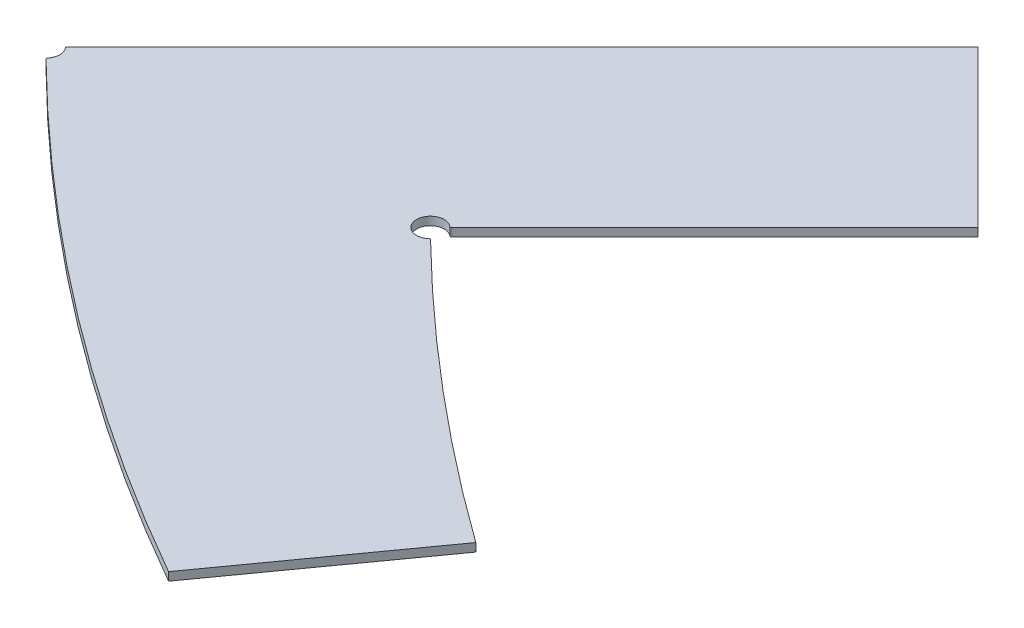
from build123d import *

# Parameters (mm, degrees)
BOSS_EXTRUDE1_DEPTH = 0.9525


with BuildPart() as part:
    # Sketch1 → Boss-Extrude1 (new, symmetric)
    with BuildSketch(Plane(origin=(47.465922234, 0, -3.640024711), x_dir=(1, 0, 0), z_dir=(0, 1, 0))):
        with BuildLine():
            Line((-325.922783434, -453.90723638), (-355.403980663, -494.965209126))
            ThreePointArc((-355.403980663, -494.965209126), (-416.290166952, -454.838580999), (-471.411506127, -407.10063034))
            ThreePointArc((-471.411506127, -407.10063034), (-471.486786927, -406.93050845), (-471.425931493, -406.754709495))
            ThreePointArc((-471.425931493, -406.754709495), (-470.662485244, -404.684634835), (-471.432284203, -402.616914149))
            ThreePointArc((-471.432284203, -402.616914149), (-471.493693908, -402.441692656), (-471.419473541, -402.271501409))
            Line((-471.419473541, -402.271501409), (-366.841166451, -297.693194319))
            Line((-366.841166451, -297.693194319), (-330.920141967, -333.614218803))
            Line((-330.920141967, -333.614218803), (-391.363926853, -394.058003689))
            ThreePointArc((-391.363926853, -394.058003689), (-391.5341181, -394.132224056), (-391.709339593, -394.070814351))
            ThreePointArc((-391.709339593, -394.070814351), (-396.956918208, -396.486280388), (-391.693825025, -398.867752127))
            ThreePointArc((-391.693825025, -398.867752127), (-391.519392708, -398.805198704), (-391.348890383, -398.877783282))
            ThreePointArc((-391.348890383, -398.877783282), (-359.689760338, -427.645549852), (-325.922783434, -453.90723638))
        make_face()
    extrude(amount=BOSS_EXTRUDE1_DEPTH, both=True)


solid = part.part
